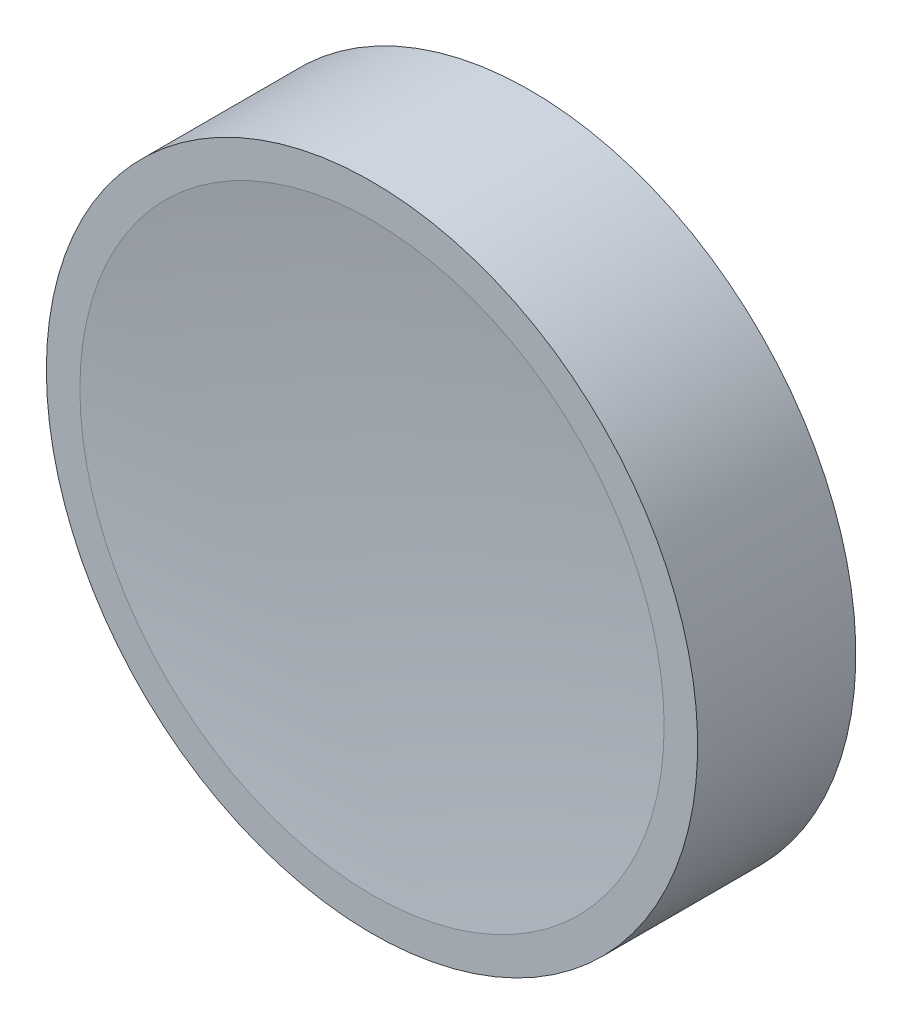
from build123d import *

# Parameters (mm, degrees)
SKETCH1_R           = 17
BOSS_EXTRUDE1_DEPTH = 9.6572
SKETCH4_W           = 1.75
SKETCH4_H           = 1.171201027
SKETCH4_H_2         = 0.227665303


with BuildPart() as part:
    # Sketch1 → Boss-Extrude1 (new body)
    with BuildSketch(Plane.XY):
        Circle(SKETCH1_R)
    extrude(amount=BOSS_EXTRUDE1_DEPTH)

    # Sketch2 → Cut-Revolve1 (revolve, cut)
    with BuildSketch(Plane(origin=(0, 0, 0), x_dir=(1, 0, 0), z_dir=(0, 1, 0)), mode=Mode.PRIVATE) as cut_revolve1_sk:
        with BuildLine():
            Line((17, 0), (0, 0))
            Line((0, 0), (0, -5.502743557))
            ThreePointArc((0, -5.502743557), (8.934206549, -4.092795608), (17, 0))
        make_face()
    revolve(cut_revolve1_sk.sketch.rotate(Axis((0, 0, 0), (0, 0, 1)), 180), axis=Axis((0, 0, 0), (0, 0, 1)), mode=Mode.SUBTRACT)

    # Sketch3 → Cut-Revolve2 (revolve, cut)
    with BuildSketch(Plane(origin=(0, 0, 0), x_dir=(1, 0, 0), z_dir=(0, 1, 0))):
        with BuildLine():
            Line((17, -9.6572), (0, -9.6572))
            Line((0, -9.6572), (0, -8.495767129))
            ThreePointArc((0, -8.495767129), (8.519814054, -8.786463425), (17, -9.6572))
        make_face()
    revolve(axis=Axis((0, 0, 9.6572), (0, 0, -1)), mode=Mode.SUBTRACT)

    # Sketch4 → Cut-Revolve3 (revolve, cut)
    with BuildSketch(Plane(origin=(0, 0, 0), x_dir=(1, 0, 0), z_dir=(0, 1, 0)), mode=Mode.PRIVATE) as cut_revolve3_sk:
        with Locations((-16.125, -0.585600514)):
            Rectangle(SKETCH4_W, SKETCH4_H)
        with Locations((-16.125, -9.543367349)):
            Rectangle(SKETCH4_W, SKETCH4_H_2)
    revolve(cut_revolve3_sk.sketch.rotate(Axis((0, 0, 0), (0, 0, 1)), 180), axis=Axis((0, 0, 0), (0, 0, 1)), mode=Mode.SUBTRACT)


solid = part.part
